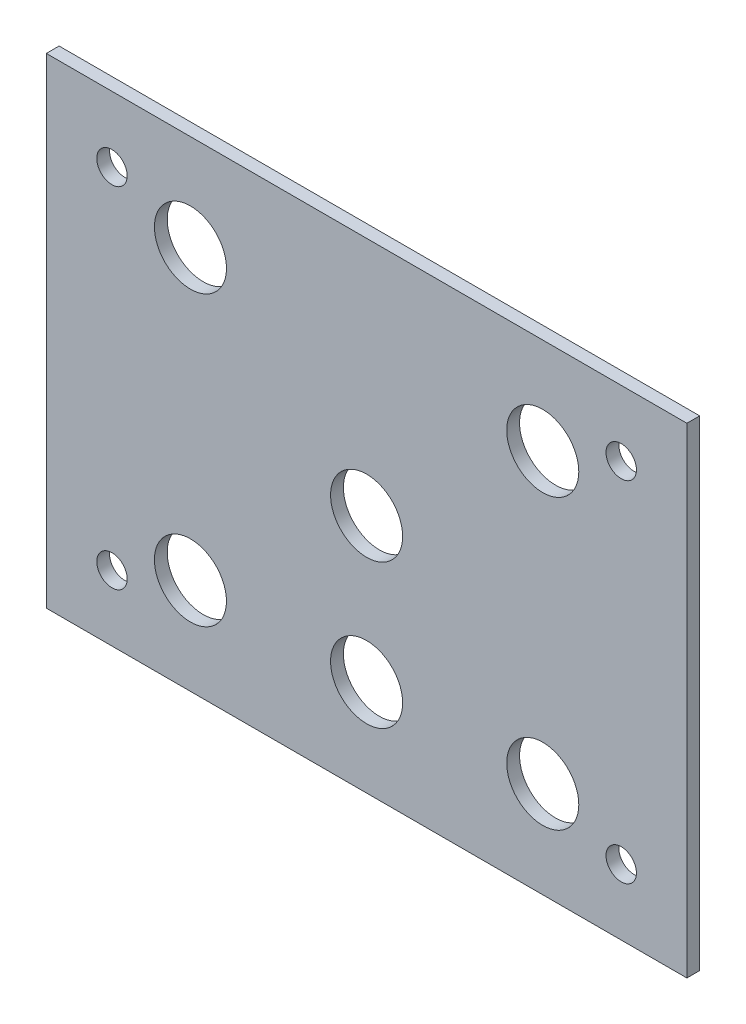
from build123d import *

# Parameters (mm, degrees)
ESQUISSE1_W             = 200
ESQUISSE1_H             = 150
FACADE_DEPTH            = 4
ESQUISSE4_R             = 4.75
TROUS_DE_FIXATION_DEPTH = 251.031997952
FACE_AV_BOUTONS_R       = 11.25
PERCAGE_TROUS_DEPTH     = 251.031997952


with BuildPart() as part:
    # Esquisse1 → facade (new body)
    with BuildSketch(Plane.XY):
        with Locations((100, 75)):
            Rectangle(ESQUISSE1_W, ESQUISSE1_H)
    extrude(amount=FACADE_DEPTH)

    # Esquisse4 → trous de fixation (cut, through all)
    with BuildSketch(Plane.XY):
        with Locations((20.5, 129.5)):
            Circle(ESQUISSE4_R)
        with Locations((179.5, 20.5)):
            Circle(ESQUISSE4_R)
        with Locations((179.5, 129.5)):
            Circle(ESQUISSE4_R)
        with Locations((20.5, 20.5)):
            Circle(ESQUISSE4_R)
    extrude(amount=TROUS_DE_FIXATION_DEPTH, mode=Mode.SUBTRACT)

    # Face_AV_boutons → percage trous (cut, through all)
    with BuildSketch(Plane.XY.offset(4)):
        with Locations((45, 120)):
            Circle(FACE_AV_BOUTONS_R)
        with Locations((155, 120)):
            Circle(FACE_AV_BOUTONS_R)
        with Locations((100, 30)):
            Circle(FACE_AV_BOUTONS_R)
        with Locations((45, 30)):
            Circle(FACE_AV_BOUTONS_R)
        with Locations((100, 75)):
            Circle(FACE_AV_BOUTONS_R)
        with Locations((155, 30)):
            Circle(FACE_AV_BOUTONS_R)
    extrude(amount=-PERCAGE_TROUS_DEPTH, mode=Mode.SUBTRACT)


solid = part.part
